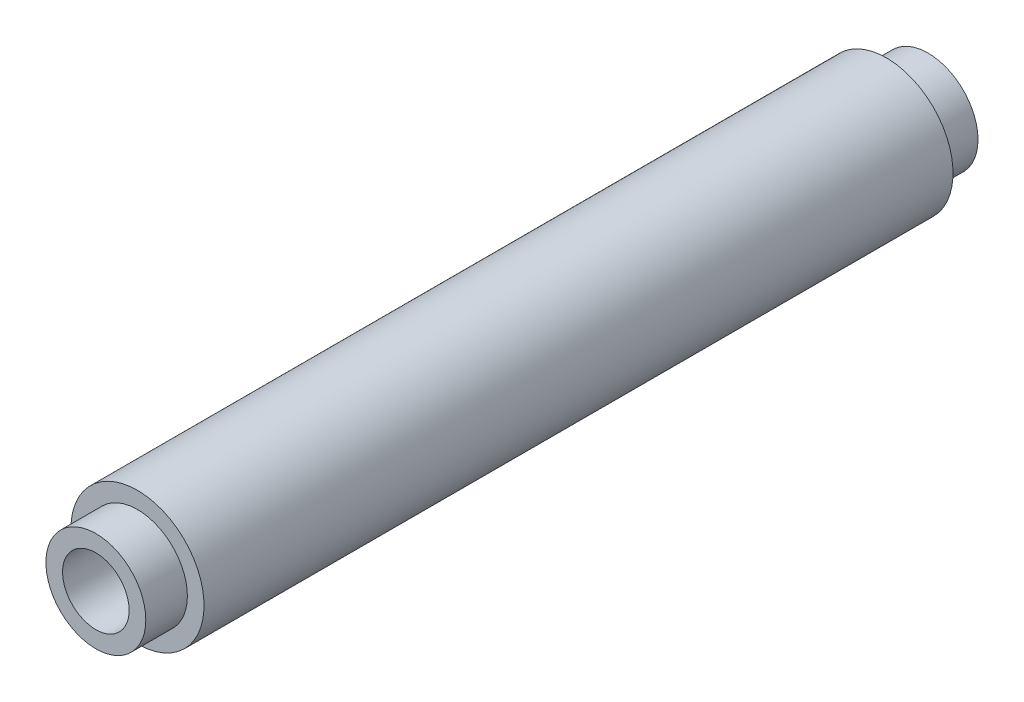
from build123d import *

# Parameters (mm, degrees)
SKETCH1_R                = 8
BOSS_EXTRUDE1_DEPTH      = 90
BOSS_EXTRUDE2_DEPTH      = 5
BOSS_EXTRUDE2_DEPTH_BACK = 95
SKETCH2_R                = 6
SKETCH2_R_2              = 4
SKETCH3_R                = 4
CUT_EXTRUDE1_DEPTH       = 10
SKETCH4_R                = 4
CUT_EXTRUDE2_DEPTH       = 10


with BuildPart() as part:
    # Sketch1 → Boss-Extrude1 (new body)
    with BuildSketch(Plane.XY):
        with Locations(Location((0, 0, 0), (0, 0, 180))):
            Circle(SKETCH1_R)
    extrude(amount=BOSS_EXTRUDE1_DEPTH)

    # Sketch2 → Boss-Extrude2 (add, two sides: drawn at the far end of the back side and taken through both)
    with BuildSketch(Plane.XY.offset(90).offset(-BOSS_EXTRUDE2_DEPTH_BACK)):
        Circle(SKETCH2_R)
        Circle(SKETCH2_R_2, mode=Mode.SUBTRACT)
    extrude(amount=BOSS_EXTRUDE2_DEPTH + BOSS_EXTRUDE2_DEPTH_BACK)

    # Sketch3 → Cut-Extrude1 (cut)
    with BuildSketch(Plane(origin=(0, 0, 0), x_dir=(-1, 0, 0), z_dir=(0, 0, -1))):
        with Locations(Location((0, 0, 0), (0, 0, 180))):
            Circle(SKETCH3_R)
    extrude(amount=-CUT_EXTRUDE1_DEPTH, mode=Mode.SUBTRACT)

    # Sketch4 → Cut-Extrude2 (cut)
    with BuildSketch(Plane.XY.offset(90)):
        Circle(SKETCH4_R)
    extrude(amount=-CUT_EXTRUDE2_DEPTH, mode=Mode.SUBTRACT)


solid = part.part
